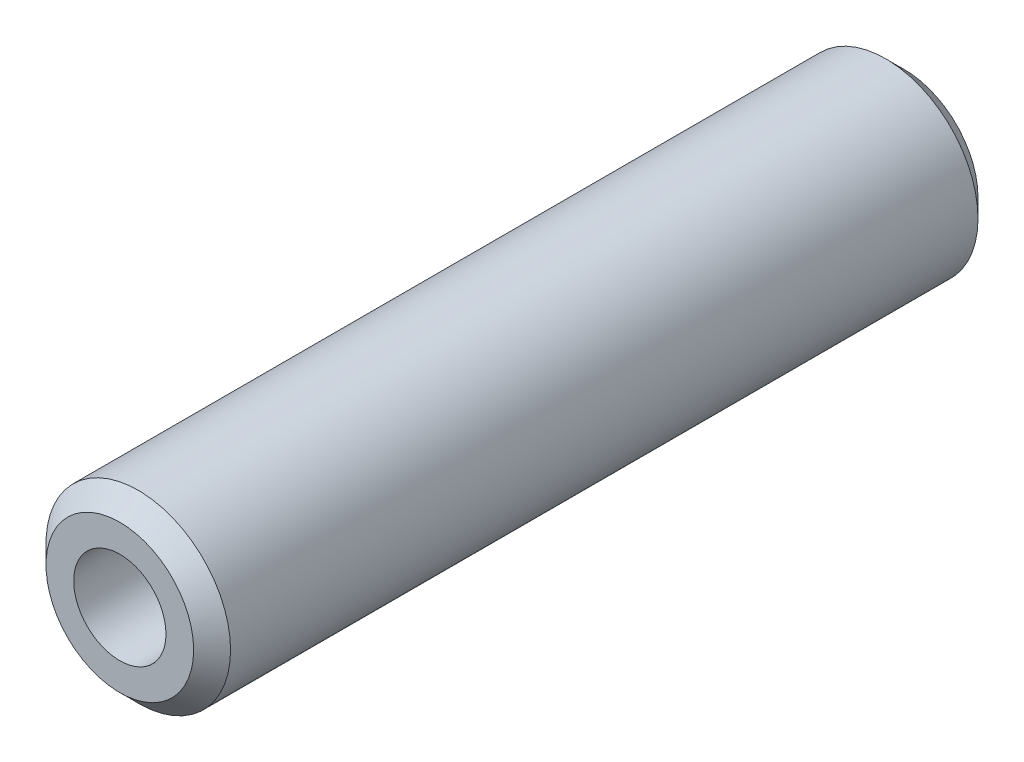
ISO-10303-21;
HEADER;
FILE_DESCRIPTION(('STEP AP214'),'2;1');
FILE_NAME('part.step','',(''),(''),'','','');
FILE_SCHEMA(('AUTOMOTIVE_DESIGN { 1 0 10303 214 1 1 1 1 }'));
ENDSEC;
DATA;
#1=APPLICATION_CONTEXT('core data for automotive mechanical design processes');
#2=APPLICATION_PROTOCOL_DEFINITION('international standard','automotive_design',2000,#1);
#3=PRODUCT_CONTEXT('',#1,'mechanical');
#4=PRODUCT('Part','Part','',(#3));
#5=PRODUCT_RELATED_PRODUCT_CATEGORY('part','',(#4));
#6=PRODUCT_DEFINITION_FORMATION('','',#4);
#7=PRODUCT_DEFINITION_CONTEXT('part definition',#1,'design');
#8=PRODUCT_DEFINITION('design','',#6,#7);
#9=PRODUCT_DEFINITION_SHAPE('','',#8);
#10=(LENGTH_UNIT() NAMED_UNIT(*) SI_UNIT(.MILLI.,.METRE.));
#11=(NAMED_UNIT(*) PLANE_ANGLE_UNIT() SI_UNIT($,.RADIAN.));
#12=(NAMED_UNIT(*) SI_UNIT($,.STERADIAN.) SOLID_ANGLE_UNIT());
#13=UNCERTAINTY_MEASURE_WITH_UNIT(LENGTH_MEASURE(1.E-05),#10,'distance_accuracy_value','');
#14=(GEOMETRIC_REPRESENTATION_CONTEXT(3) GLOBAL_UNCERTAINTY_ASSIGNED_CONTEXT((#13)) GLOBAL_UNIT_ASSIGNED_CONTEXT((#10,
#11,#12)) REPRESENTATION_CONTEXT('',''));
#15=CARTESIAN_POINT('',(0.,0.,0.));
#16=DIRECTION('',(0.,0.,1.));
#17=DIRECTION('',(1.,0.,0.));
#18=AXIS2_PLACEMENT_3D('',#15,#16,#17);
#19=CARTESIAN_POINT('',(0.,0.,8.5));
#20=DIRECTION('',(0.,0.,1.));
#21=DIRECTION('',(1.,0.,0.));
#22=AXIS2_PLACEMENT_3D('',#19,#20,#21);
#23=PLANE('',#22);
#24=CARTESIAN_POINT('',(0.,0.,8.5));
#25=DIRECTION('',(0.,0.,1.));
#26=DIRECTION('',(1.,0.,0.));
#27=AXIS2_PLACEMENT_3D('',#24,#25,#26);
#28=CIRCLE('',#27,1.6);
#29=CARTESIAN_POINT('',(1.6,0.,8.5));
#30=VERTEX_POINT('',#29);
#31=EDGE_CURVE('E10',#30,#30,#28,.T.);
#32=ORIENTED_EDGE('',*,*,#31,.T.);
#33=EDGE_LOOP('',(#32));
#34=FACE_BOUND('',#33,.T.);
#35=CARTESIAN_POINT('',(0.,0.,8.5));
#36=DIRECTION('',(0.,0.,1.));
#37=DIRECTION('',(1.,0.,0.));
#38=AXIS2_PLACEMENT_3D('',#35,#36,#37);
#39=CIRCLE('',#38,1.);
#40=CARTESIAN_POINT('',(1.,0.,8.5));
#41=VERTEX_POINT('',#40);
#42=EDGE_CURVE('E52',#41,#41,#39,.T.);
#43=ORIENTED_EDGE('',*,*,#42,.F.);
#44=EDGE_LOOP('',(#43));
#45=FACE_BOUND('',#44,.T.);
#46=ADVANCED_FACE('F32',(#34,#45),#23,.T.);
#47=CARTESIAN_POINT('',(0.,0.,-8.5));
#48=DIRECTION('',(0.,0.,1.));
#49=DIRECTION('',(1.,0.,0.));
#50=AXIS2_PLACEMENT_3D('',#47,#48,#49);
#51=PLANE('',#50);
#52=CARTESIAN_POINT('',(0.,0.,-8.5));
#53=DIRECTION('',(0.,0.,1.));
#54=DIRECTION('',(1.,0.,0.));
#55=AXIS2_PLACEMENT_3D('',#52,#53,#54);
#56=CIRCLE('',#55,1.6);
#57=CARTESIAN_POINT('',(1.6,0.,-8.5));
#58=VERTEX_POINT('',#57);
#59=EDGE_CURVE('E39',#58,#58,#56,.F.);
#60=ORIENTED_EDGE('',*,*,#59,.T.);
#61=EDGE_LOOP('',(#60));
#62=FACE_BOUND('',#61,.T.);
#63=CARTESIAN_POINT('',(0.,0.,-8.5));
#64=DIRECTION('',(0.,0.,1.));
#65=DIRECTION('',(1.,0.,0.));
#66=AXIS2_PLACEMENT_3D('',#63,#64,#65);
#67=CIRCLE('',#66,1.);
#68=CARTESIAN_POINT('',(1.,0.,-8.5));
#69=VERTEX_POINT('',#68);
#70=EDGE_CURVE('E55',#69,#69,#67,.T.);
#71=ORIENTED_EDGE('',*,*,#70,.T.);
#72=EDGE_LOOP('',(#71));
#73=FACE_BOUND('',#72,.T.);
#74=ADVANCED_FACE('F59',(#62,#73),#51,.F.);
#75=CARTESIAN_POINT('',(0.,0.,8.5));
#76=DIRECTION('',(0.,0.,-1.));
#77=DIRECTION('',(-1.,0.,0.));
#78=AXIS2_PLACEMENT_3D('',#75,#76,#77);
#79=CYLINDRICAL_SURFACE('',#78,2.);
#80=CARTESIAN_POINT('',(0.,0.,-8.1));
#81=DIRECTION('',(0.,0.,1.));
#82=DIRECTION('',(1.,0.,0.));
#83=AXIS2_PLACEMENT_3D('',#80,#81,#82);
#84=CIRCLE('',#83,2.);
#85=CARTESIAN_POINT('',(2.,0.,-8.1));
#86=VERTEX_POINT('',#85);
#87=EDGE_CURVE('E43',#86,#86,#84,.T.);
#88=ORIENTED_EDGE('',*,*,#87,.T.);
#89=EDGE_LOOP('',(#88));
#90=FACE_BOUND('',#89,.T.);
#91=CARTESIAN_POINT('',(0.,0.,8.1));
#92=DIRECTION('',(0.,0.,1.));
#93=DIRECTION('',(1.,0.,0.));
#94=AXIS2_PLACEMENT_3D('',#91,#92,#93);
#95=CIRCLE('',#94,2.);
#96=CARTESIAN_POINT('',(2.,0.,8.1));
#97=VERTEX_POINT('',#96);
#98=EDGE_CURVE('E47',#97,#97,#95,.F.);
#99=ORIENTED_EDGE('',*,*,#98,.T.);
#100=EDGE_LOOP('',(#99));
#101=FACE_BOUND('',#100,.T.);
#102=ADVANCED_FACE('F34',(#90,#101),#79,.T.);
#103=CARTESIAN_POINT('',(0.,0.,8.5));
#104=DIRECTION('',(0.,0.,-1.));
#105=DIRECTION('',(-1.,0.,0.));
#106=AXIS2_PLACEMENT_3D('',#103,#104,#105);
#107=CYLINDRICAL_SURFACE('',#106,1.);
#108=ORIENTED_EDGE('',*,*,#42,.T.);
#109=EDGE_LOOP('',(#108));
#110=FACE_BOUND('',#109,.T.);
#111=ORIENTED_EDGE('',*,*,#70,.F.);
#112=EDGE_LOOP('',(#111));
#113=FACE_BOUND('',#112,.T.);
#114=ADVANCED_FACE('F61',(#110,#113),#107,.F.);
#115=CARTESIAN_POINT('',(0.,0.,-8.1));
#116=DIRECTION('',(0.,0.,1.));
#117=DIRECTION('',(1.,0.,0.));
#118=AXIS2_PLACEMENT_3D('',#115,#116,#117);
#119=CONICAL_SURFACE('',#118,2.,0.785398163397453);
#120=ORIENTED_EDGE('',*,*,#59,.F.);
#121=EDGE_LOOP('',(#120));
#122=FACE_BOUND('',#121,.T.);
#123=ORIENTED_EDGE('',*,*,#87,.F.);
#124=EDGE_LOOP('',(#123));
#125=FACE_BOUND('',#124,.T.);
#126=ADVANCED_FACE('F63',(#122,#125),#119,.T.);
#127=CARTESIAN_POINT('',(0.,0.,8.5));
#128=DIRECTION('',(0.,0.,-1.));
#129=DIRECTION('',(-1.,0.,0.));
#130=AXIS2_PLACEMENT_3D('',#127,#128,#129);
#131=CONICAL_SURFACE('',#130,1.6,0.785398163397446);
#132=ORIENTED_EDGE('',*,*,#98,.F.);
#133=EDGE_LOOP('',(#132));
#134=FACE_BOUND('',#133,.T.);
#135=ORIENTED_EDGE('',*,*,#31,.F.);
#136=EDGE_LOOP('',(#135));
#137=FACE_BOUND('',#136,.T.);
#138=ADVANCED_FACE('F70',(#134,#137),#131,.T.);
#139=CLOSED_SHELL('',(#46,#74,#102,#114,#126,#138));
#140=MANIFOLD_SOLID_BREP('B2',#139);
#141=ADVANCED_BREP_SHAPE_REPRESENTATION('',(#18,#140),#14);
#142=SHAPE_DEFINITION_REPRESENTATION(#9,#141);
ENDSEC;
END-ISO-10303-21;
